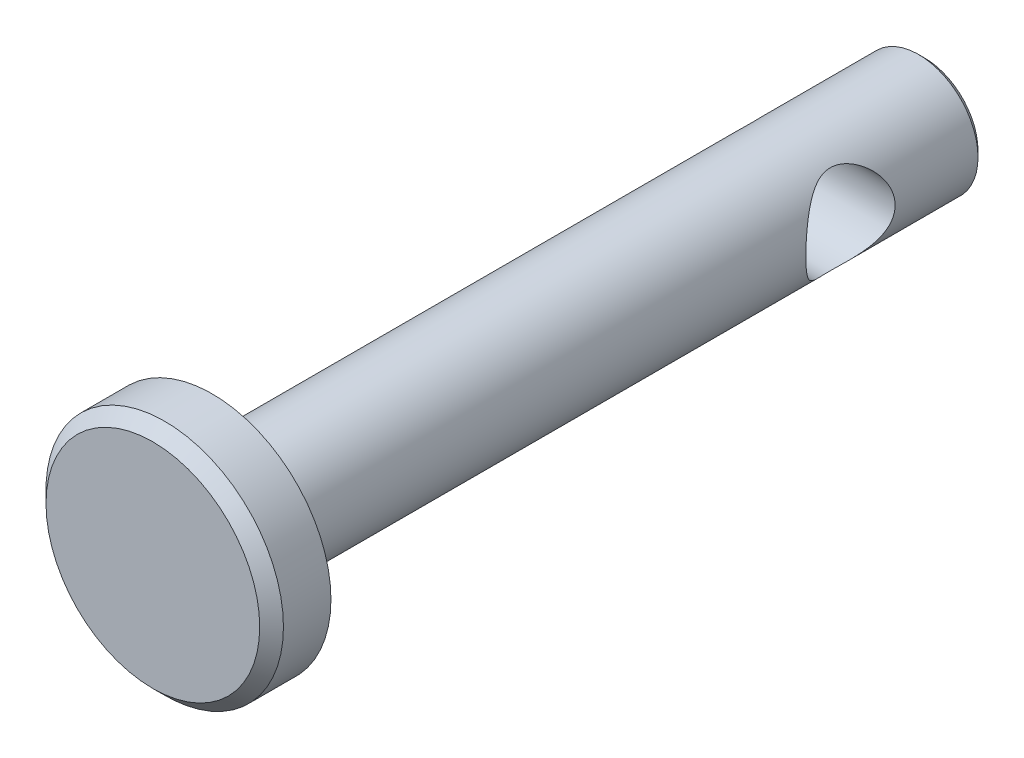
ISO-10303-21;
HEADER;
FILE_DESCRIPTION(('STEP AP214'),'2;1');
FILE_NAME('part.step','',(''),(''),'','','');
FILE_SCHEMA(('AUTOMOTIVE_DESIGN { 1 0 10303 214 1 1 1 1 }'));
ENDSEC;
DATA;
#1=APPLICATION_CONTEXT('core data for automotive mechanical design processes');
#2=APPLICATION_PROTOCOL_DEFINITION('international standard','automotive_design',2000,#1);
#3=PRODUCT_CONTEXT('',#1,'mechanical');
#4=PRODUCT('Part','Part','',(#3));
#5=PRODUCT_RELATED_PRODUCT_CATEGORY('part','',(#4));
#6=PRODUCT_DEFINITION_FORMATION('','',#4);
#7=PRODUCT_DEFINITION_CONTEXT('part definition',#1,'design');
#8=PRODUCT_DEFINITION('design','',#6,#7);
#9=PRODUCT_DEFINITION_SHAPE('','',#8);
#10=(LENGTH_UNIT() NAMED_UNIT(*) SI_UNIT(.MILLI.,.METRE.));
#11=(NAMED_UNIT(*) PLANE_ANGLE_UNIT() SI_UNIT($,.RADIAN.));
#12=(NAMED_UNIT(*) SI_UNIT($,.STERADIAN.) SOLID_ANGLE_UNIT());
#13=UNCERTAINTY_MEASURE_WITH_UNIT(LENGTH_MEASURE(1.E-05),#10,'distance_accuracy_value','');
#14=(GEOMETRIC_REPRESENTATION_CONTEXT(3) GLOBAL_UNCERTAINTY_ASSIGNED_CONTEXT((#13)) GLOBAL_UNIT_ASSIGNED_CONTEXT((#10,
#11,#12)) REPRESENTATION_CONTEXT('',''));
#15=CARTESIAN_POINT('',(0.,0.,0.));
#16=DIRECTION('',(0.,0.,1.));
#17=DIRECTION('',(1.,0.,0.));
#18=AXIS2_PLACEMENT_3D('',#15,#16,#17);
#19=CARTESIAN_POINT('',(0.,0.,9.525));
#20=DIRECTION('',(0.,0.,-1.));
#21=DIRECTION('',(-1.,0.,0.));
#22=AXIS2_PLACEMENT_3D('',#19,#20,#21);
#23=CYLINDRICAL_SURFACE('',#22,1.5875);
#24=CARTESIAN_POINT('',(0.,0.,-9.36624999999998));
#25=DIRECTION('',(0.,0.,1.));
#26=DIRECTION('',(1.,0.,0.));
#27=AXIS2_PLACEMENT_3D('',#24,#25,#26);
#28=CIRCLE('',#27,1.5875);
#29=CARTESIAN_POINT('',(1.5875,0.,-9.36624999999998));
#30=VERTEX_POINT('',#29);
#31=EDGE_CURVE('E37',#30,#30,#28,.T.);
#32=ORIENTED_EDGE('',*,*,#31,.T.);
#33=EDGE_LOOP('',(#32));
#34=FACE_BOUND('',#33,.T.);
#35=CARTESIAN_POINT('',(-1.5875,0.,-4.7625));
#36=CARTESIAN_POINT('',(-1.58749611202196,-0.0582400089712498,-4.76250404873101));
#37=CARTESIAN_POINT('',(-1.58426132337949,-0.116571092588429,-4.76679645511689));
#38=CARTESIAN_POINT('',(-1.57161329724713,-0.231395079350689,-4.78369572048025));
#39=CARTESIAN_POINT('',(-1.56218511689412,-0.287883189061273,-4.7963226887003));
#40=CARTESIAN_POINT('',(-1.53805521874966,-0.397051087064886,-4.82903029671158));
#41=CARTESIAN_POINT('',(-1.52338545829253,-0.449751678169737,-4.84906579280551));
#42=CARTESIAN_POINT('',(-1.48987548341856,-0.550689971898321,-4.89564346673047));
#43=CARTESIAN_POINT('',(-1.4710363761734,-0.598928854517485,-4.92218391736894));
#44=CARTESIAN_POINT('',(-1.42848471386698,-0.6946800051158,-4.98361872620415));
#45=CARTESIAN_POINT('',(-1.4044822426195,-0.741710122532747,-5.0190595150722));
#46=CARTESIAN_POINT('',(-1.35445854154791,-0.829553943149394,-5.09582999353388));
#47=CARTESIAN_POINT('',(-1.32843424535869,-0.870357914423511,-5.1371687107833));
#48=CARTESIAN_POINT('',(-1.27068479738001,-0.953179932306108,-5.23416999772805));
#49=CARTESIAN_POINT('',(-1.23888117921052,-0.993742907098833,-5.29103351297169));
#50=CARTESIAN_POINT('',(-1.17827563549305,-1.06489206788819,-5.41216340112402));
#51=CARTESIAN_POINT('',(-1.14946970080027,-1.09549169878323,-5.47641963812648));
#52=CARTESIAN_POINT('',(-1.10835974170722,-1.13676501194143,-5.58866025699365));
#53=CARTESIAN_POINT('',(-1.09379064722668,-1.1506712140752,-5.63461480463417));
#54=CARTESIAN_POINT('',(-1.06983233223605,-1.17298121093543,-5.72910159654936));
#55=CARTESIAN_POINT('',(-1.06043121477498,-1.1813976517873,-5.77762763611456));
#56=CARTESIAN_POINT('',(-1.04829075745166,-1.19218967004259,-5.87667588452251));
#57=CARTESIAN_POINT('',(-1.045613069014,-1.19450935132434,-5.92721228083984));
#58=CARTESIAN_POINT('',(-1.04766413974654,-1.19270985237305,-6.02802847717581));
#59=CARTESIAN_POINT('',(-1.0523953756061,-1.18858851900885,-6.07830818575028));
#60=CARTESIAN_POINT('',(-1.06743533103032,-1.17508360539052,-6.17150859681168));
#61=CARTESIAN_POINT('',(-1.07708192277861,-1.16632068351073,-6.21463515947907));
#62=CARTESIAN_POINT('',(-1.10026903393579,-1.14447308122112,-6.29868602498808));
#63=CARTESIAN_POINT('',(-1.11381333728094,-1.13138419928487,-6.33960814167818));
#64=CARTESIAN_POINT('',(-1.15290197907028,-1.09185551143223,-6.44394351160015));
#65=CARTESIAN_POINT('',(-1.18063622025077,-1.06219612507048,-6.50531645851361));
#66=CARTESIAN_POINT('',(-1.23884845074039,-0.993702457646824,-6.6213324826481));
#67=CARTESIAN_POINT('',(-1.26933302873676,-0.954845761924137,-6.67595861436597));
#68=CARTESIAN_POINT('',(-1.33071770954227,-0.867340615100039,-6.77945482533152));
#69=CARTESIAN_POINT('',(-1.36160815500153,-0.818464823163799,-6.82813939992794));
#70=CARTESIAN_POINT('',(-1.42018729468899,-0.711972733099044,-6.9170529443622));
#71=CARTESIAN_POINT('',(-1.44788202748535,-0.654373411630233,-6.9572979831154));
#72=CARTESIAN_POINT('',(-1.49255937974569,-0.543375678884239,-7.02078774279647));
#73=CARTESIAN_POINT('',(-1.51057698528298,-0.491421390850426,-7.04582173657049));
#74=CARTESIAN_POINT('',(-1.54160267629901,-0.383120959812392,-7.08844643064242));
#75=CARTESIAN_POINT('',(-1.55461387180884,-0.326777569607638,-7.10604175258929));
#76=CARTESIAN_POINT('',(-1.57456526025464,-0.210682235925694,-7.13287955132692));
#77=CARTESIAN_POINT('',(-1.58146728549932,-0.1509113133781,-7.14206952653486));
#78=CARTESIAN_POINT('',(-1.58835864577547,-0.0302752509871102,-7.15124574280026));
#79=CARTESIAN_POINT('',(-1.58835103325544,0.0305893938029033,-7.15123604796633));
#80=CARTESIAN_POINT('',(-1.58179458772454,0.145018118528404,-7.14250495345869));
#81=CARTESIAN_POINT('',(-1.57591384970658,0.198692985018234,-7.13467332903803));
#82=CARTESIAN_POINT('',(-1.55908265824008,0.303723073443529,-7.11206716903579));
#83=CARTESIAN_POINT('',(-1.54813114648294,0.355077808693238,-7.09729118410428));
#84=CARTESIAN_POINT('',(-1.5215117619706,0.456045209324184,-7.0609081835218));
#85=CARTESIAN_POINT('',(-1.50569808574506,0.505541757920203,-7.0390887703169));
#86=CARTESIAN_POINT('',(-1.47055050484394,0.600156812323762,-6.98965499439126));
#87=CARTESIAN_POINT('',(-1.45121610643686,0.645274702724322,-6.96203981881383));
#88=CARTESIAN_POINT('',(-1.40668133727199,0.737877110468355,-6.89673625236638));
#89=CARTESIAN_POINT('',(-1.38104027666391,0.78450486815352,-6.85813622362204));
#90=CARTESIAN_POINT('',(-1.32814791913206,0.871068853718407,-6.77484438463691));
#91=CARTESIAN_POINT('',(-1.30089319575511,0.91099009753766,-6.73013932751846));
#92=CARTESIAN_POINT('',(-1.24150416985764,0.990828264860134,-6.6260177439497));
#93=CARTESIAN_POINT('',(-1.20943783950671,1.02927233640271,-6.56542468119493));
#94=CARTESIAN_POINT('',(-1.14994929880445,1.09532583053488,-6.43654051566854));
#95=CARTESIAN_POINT('',(-1.12251399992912,1.12296608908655,-6.36827204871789));
#96=CARTESIAN_POINT('',(-1.08675452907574,1.15736064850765,-6.25256084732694));
#97=CARTESIAN_POINT('',(-1.07514574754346,1.16805755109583,-6.20731938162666));
#98=CARTESIAN_POINT('',(-1.05740659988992,1.18414258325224,-6.1149003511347));
#99=CARTESIAN_POINT('',(-1.05126379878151,1.18954276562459,-6.06772743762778));
#100=CARTESIAN_POINT('',(-1.04546055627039,1.19464934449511,-5.97239421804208));
#101=CARTESIAN_POINT('',(-1.04583560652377,1.19432456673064,-5.92422993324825));
#102=CARTESIAN_POINT('',(-1.05308483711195,1.18793443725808,-5.82875862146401));
#103=CARTESIAN_POINT('',(-1.05996708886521,1.18186195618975,-5.78145273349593));
#104=CARTESIAN_POINT('',(-1.08105685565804,1.16263091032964,-5.67939139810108));
#105=CARTESIAN_POINT('',(-1.09648769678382,1.14826379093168,-5.62512604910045));
#106=CARTESIAN_POINT('',(-1.13243372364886,1.11282760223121,-5.52059746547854));
#107=CARTESIAN_POINT('',(-1.15296179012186,1.09174151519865,-5.47034480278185));
#108=CARTESIAN_POINT('',(-1.20451193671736,1.03501018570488,-5.35693003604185));
#109=CARTESIAN_POINT('',(-1.23666801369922,0.996854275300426,-5.29554225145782));
#110=CARTESIAN_POINT('',(-1.30163587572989,0.910405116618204,-5.18074463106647));
#111=CARTESIAN_POINT('',(-1.33444825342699,0.862102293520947,-5.12734241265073));
#112=CARTESIAN_POINT('',(-1.39773998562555,0.755232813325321,-5.02888025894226));
#113=CARTESIAN_POINT('',(-1.42819461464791,0.696574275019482,-4.98390312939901));
#114=CARTESIAN_POINT('',(-1.48324162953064,0.569981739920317,-4.9047231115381));
#115=CARTESIAN_POINT('',(-1.50784795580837,0.50207041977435,-4.87049453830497));
#116=CARTESIAN_POINT('',(-1.54233051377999,0.379688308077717,-4.82317967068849));
#117=CARTESIAN_POINT('',(-1.55440989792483,0.327083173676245,-4.80683830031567));
#118=CARTESIAN_POINT('',(-1.57322723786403,0.219278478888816,-4.78151498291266));
#119=CARTESIAN_POINT('',(-1.57997976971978,0.164086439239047,-4.77251295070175));
#120=CARTESIAN_POINT('',(-1.58502674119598,0.0904161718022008,-4.76579069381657));
#121=CARTESIAN_POINT('',(-1.58595256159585,0.072371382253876,-4.76455840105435));
#122=CARTESIAN_POINT('',(-1.58718985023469,0.0362206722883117,-4.76291235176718));
#123=CARTESIAN_POINT('',(-1.58750120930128,0.0181147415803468,-4.76249874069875));
#124=CARTESIAN_POINT('',(-1.5875,0.,-4.7625));
#125=B_SPLINE_CURVE_WITH_KNOTS('',3,(#35,#36,#37,#38,#39,#40,#41,#42,#43,#44,#45,#46,#47,#48,
#49,#50,#51,#52,#53,#54,#55,#56,#57,#58,#59,#60,#61,#62,#63,#64,#65,#66,#67,#68,#69,#70,#71,#72,
#73,#74,#75,#76,#77,#78,#79,#80,#81,#82,#83,#84,#85,#86,#87,#88,#89,#90,#91,#92,#93,#94,#95,#96,
#97,#98,#99,#100,#101,#102,#103,#104,#105,#106,#107,#108,#109,#110,#111,#112,#113,#114,#115,
#116,#117,#118,#119,#120,#121,#122,#123,#124),.UNSPECIFIED.,.T.,.F.,(4,2,2,2,2,2,2,2,2,2,2,2,2,
2,2,2,2,2,2,2,2,2,2,2,2,2,2,2,2,2,2,2,2,2,2,2,2,2,2,2,2,2,2,2,4),(0.,0.174640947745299,
0.349704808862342,0.523719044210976,0.697687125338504,0.887786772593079,1.07818058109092,
1.30747198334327,1.53645267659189,1.68647155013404,1.83614361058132,1.98718317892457,
2.13827324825,2.27294091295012,2.40773975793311,2.62731202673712,2.84742502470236,
3.07323328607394,3.29860762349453,3.47914313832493,3.65956632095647,3.84110891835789,
4.02257131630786,4.18550204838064,4.34846680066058,4.51689478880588,4.68534641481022,
4.88184568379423,5.07877830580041,5.31352668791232,5.54760007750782,5.69082209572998,
5.83371744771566,5.97739115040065,6.12124329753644,6.29493375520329,6.4690676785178,
6.70520286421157,6.94156188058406,7.18013431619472,7.41813223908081,7.58663566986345,
7.75467640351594,7.80898638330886,7.86330601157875),.UNSPECIFIED.);
#126=CARTESIAN_POINT('',(-1.5875,0.,-4.7625));
#127=VERTEX_POINT('',#126);
#128=EDGE_CURVE('E48',#127,#127,#125,.T.);
#129=ORIENTED_EDGE('',*,*,#128,.T.);
#130=EDGE_LOOP('',(#129));
#131=FACE_BOUND('',#130,.T.);
#132=CARTESIAN_POINT('',(1.5875,0.,-7.1501));
#133=CARTESIAN_POINT('',(1.58749611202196,-0.0582400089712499,-7.15009595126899));
#134=CARTESIAN_POINT('',(1.58426132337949,-0.116571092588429,-7.1458035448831));
#135=CARTESIAN_POINT('',(1.57161329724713,-0.231395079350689,-7.12890427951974));
#136=CARTESIAN_POINT('',(1.56218511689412,-0.287883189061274,-7.11627731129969));
#137=CARTESIAN_POINT('',(1.53805521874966,-0.397051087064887,-7.08356970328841));
#138=CARTESIAN_POINT('',(1.52338545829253,-0.449751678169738,-7.06353420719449));
#139=CARTESIAN_POINT('',(1.48987548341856,-0.550689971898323,-7.01695653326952));
#140=CARTESIAN_POINT('',(1.4710363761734,-0.598928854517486,-6.99041608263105));
#141=CARTESIAN_POINT('',(1.42848471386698,-0.694680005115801,-6.92898127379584));
#142=CARTESIAN_POINT('',(1.4044822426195,-0.741710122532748,-6.89354048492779));
#143=CARTESIAN_POINT('',(1.35445854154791,-0.829553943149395,-6.81677000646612));
#144=CARTESIAN_POINT('',(1.32843424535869,-0.870357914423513,-6.7754312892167));
#145=CARTESIAN_POINT('',(1.27068479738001,-0.953179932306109,-6.67843000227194));
#146=CARTESIAN_POINT('',(1.23888117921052,-0.993742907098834,-6.62156648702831));
#147=CARTESIAN_POINT('',(1.17827563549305,-1.0648920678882,-6.50043659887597));
#148=CARTESIAN_POINT('',(1.14946970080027,-1.09549169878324,-6.43618036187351));
#149=CARTESIAN_POINT('',(1.10835974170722,-1.13676501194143,-6.32393974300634));
#150=CARTESIAN_POINT('',(1.09379064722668,-1.1506712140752,-6.27798519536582));
#151=CARTESIAN_POINT('',(1.06983233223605,-1.17298121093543,-6.18349840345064));
#152=CARTESIAN_POINT('',(1.06043121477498,-1.1813976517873,-6.13497236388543));
#153=CARTESIAN_POINT('',(1.04829075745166,-1.19218967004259,-6.03592411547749));
#154=CARTESIAN_POINT('',(1.045613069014,-1.19450935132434,-5.98538771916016));
#155=CARTESIAN_POINT('',(1.04766413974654,-1.19270985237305,-5.88457152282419));
#156=CARTESIAN_POINT('',(1.0523953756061,-1.18858851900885,-5.83429181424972));
#157=CARTESIAN_POINT('',(1.06743533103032,-1.17508360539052,-5.74109140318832));
#158=CARTESIAN_POINT('',(1.07708192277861,-1.16632068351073,-5.69796484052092));
#159=CARTESIAN_POINT('',(1.10026903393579,-1.14447308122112,-5.61391397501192));
#160=CARTESIAN_POINT('',(1.11381333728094,-1.13138419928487,-5.57299185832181));
#161=CARTESIAN_POINT('',(1.15290197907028,-1.09185551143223,-5.46865648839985));
#162=CARTESIAN_POINT('',(1.18063622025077,-1.06219612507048,-5.40728354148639));
#163=CARTESIAN_POINT('',(1.23884845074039,-0.993702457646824,-5.2912675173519));
#164=CARTESIAN_POINT('',(1.26933302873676,-0.954845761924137,-5.23664138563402));
#165=CARTESIAN_POINT('',(1.33071770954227,-0.867340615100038,-5.13314517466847));
#166=CARTESIAN_POINT('',(1.36160815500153,-0.818464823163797,-5.08446060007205));
#167=CARTESIAN_POINT('',(1.42018729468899,-0.711972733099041,-4.99554705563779));
#168=CARTESIAN_POINT('',(1.44788202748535,-0.65437341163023,-4.95530201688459));
#169=CARTESIAN_POINT('',(1.49255937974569,-0.543375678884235,-4.89181225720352));
#170=CARTESIAN_POINT('',(1.51057698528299,-0.491421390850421,-4.8667782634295));
#171=CARTESIAN_POINT('',(1.54160267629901,-0.383120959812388,-4.82415356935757));
#172=CARTESIAN_POINT('',(1.55461387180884,-0.326777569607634,-4.8065582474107));
#173=CARTESIAN_POINT('',(1.57456526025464,-0.21068223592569,-4.77972044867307));
#174=CARTESIAN_POINT('',(1.58146728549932,-0.150911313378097,-4.77053047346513));
#175=CARTESIAN_POINT('',(1.58835864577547,-0.0302752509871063,-4.76135425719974));
#176=CARTESIAN_POINT('',(1.58835103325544,0.0305893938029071,-4.76136395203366));
#177=CARTESIAN_POINT('',(1.58179458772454,0.145018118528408,-4.7700950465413));
#178=CARTESIAN_POINT('',(1.57591384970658,0.198692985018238,-4.77792667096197));
#179=CARTESIAN_POINT('',(1.55908265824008,0.303723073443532,-4.80053283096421));
#180=CARTESIAN_POINT('',(1.54813114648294,0.35507780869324,-4.81530881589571));
#181=CARTESIAN_POINT('',(1.52151176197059,0.456045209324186,-4.8516918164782));
#182=CARTESIAN_POINT('',(1.50569808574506,0.505541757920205,-4.87351122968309));
#183=CARTESIAN_POINT('',(1.47055050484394,0.600156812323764,-4.92294500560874));
#184=CARTESIAN_POINT('',(1.45121610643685,0.645274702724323,-4.95056018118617));
#185=CARTESIAN_POINT('',(1.40668133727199,0.737877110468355,-5.01586374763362));
#186=CARTESIAN_POINT('',(1.38104027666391,0.784504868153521,-5.05446377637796));
#187=CARTESIAN_POINT('',(1.32814791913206,0.871068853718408,-5.13775561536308));
#188=CARTESIAN_POINT('',(1.30089319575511,0.910990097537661,-5.18246067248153));
#189=CARTESIAN_POINT('',(1.24150416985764,0.990828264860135,-5.2865822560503));
#190=CARTESIAN_POINT('',(1.20943783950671,1.02927233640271,-5.34717531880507));
#191=CARTESIAN_POINT('',(1.14994929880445,1.09532583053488,-5.47605948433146));
#192=CARTESIAN_POINT('',(1.12251399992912,1.12296608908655,-5.54432795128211));
#193=CARTESIAN_POINT('',(1.08675452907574,1.15736064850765,-5.66003915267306));
#194=CARTESIAN_POINT('',(1.07514574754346,1.16805755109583,-5.70528061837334));
#195=CARTESIAN_POINT('',(1.05740659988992,1.18414258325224,-5.79769964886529));
#196=CARTESIAN_POINT('',(1.05126379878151,1.18954276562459,-5.84487256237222));
#197=CARTESIAN_POINT('',(1.04546055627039,1.19464934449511,-5.94020578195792));
#198=CARTESIAN_POINT('',(1.04583560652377,1.19432456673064,-5.98837006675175));
#199=CARTESIAN_POINT('',(1.05308483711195,1.18793443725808,-6.08384137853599));
#200=CARTESIAN_POINT('',(1.05996708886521,1.18186195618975,-6.13114726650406));
#201=CARTESIAN_POINT('',(1.08105685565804,1.16263091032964,-6.23320860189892));
#202=CARTESIAN_POINT('',(1.09648769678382,1.14826379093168,-6.28747395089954));
#203=CARTESIAN_POINT('',(1.13243372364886,1.11282760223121,-6.39200253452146));
#204=CARTESIAN_POINT('',(1.15296179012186,1.09174151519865,-6.44225519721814));
#205=CARTESIAN_POINT('',(1.20451193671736,1.03501018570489,-6.55566996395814));
#206=CARTESIAN_POINT('',(1.23666801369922,0.996854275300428,-6.61705774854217));
#207=CARTESIAN_POINT('',(1.30163587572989,0.910405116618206,-6.73185536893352));
#208=CARTESIAN_POINT('',(1.33444825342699,0.86210229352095,-6.78525758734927));
#209=CARTESIAN_POINT('',(1.39773998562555,0.755232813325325,-6.88371974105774));
#210=CARTESIAN_POINT('',(1.42819461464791,0.696574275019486,-6.92869687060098));
#211=CARTESIAN_POINT('',(1.48324162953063,0.569981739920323,-7.00787688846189));
#212=CARTESIAN_POINT('',(1.50784795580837,0.502070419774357,-7.04210546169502));
#213=CARTESIAN_POINT('',(1.54233051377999,0.379688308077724,-7.0894203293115));
#214=CARTESIAN_POINT('',(1.55440989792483,0.327083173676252,-7.10576169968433));
#215=CARTESIAN_POINT('',(1.57322723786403,0.219278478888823,-7.13108501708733));
#216=CARTESIAN_POINT('',(1.57997976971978,0.164086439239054,-7.14008704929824));
#217=CARTESIAN_POINT('',(1.58502674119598,0.0904161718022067,-7.14680930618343));
#218=CARTESIAN_POINT('',(1.58595256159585,0.0723713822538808,-7.14804159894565));
#219=CARTESIAN_POINT('',(1.58718985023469,0.0362206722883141,-7.14968764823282));
#220=CARTESIAN_POINT('',(1.58750120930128,0.018114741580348,-7.15010125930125));
#221=CARTESIAN_POINT('',(1.5875,0.,-7.1501));
#222=B_SPLINE_CURVE_WITH_KNOTS('',3,(#132,#133,#134,#135,#136,#137,#138,#139,#140,#141,#142,
#143,#144,#145,#146,#147,#148,#149,#150,#151,#152,#153,#154,#155,#156,#157,#158,#159,#160,#161,
#162,#163,#164,#165,#166,#167,#168,#169,#170,#171,#172,#173,#174,#175,#176,#177,#178,#179,#180,
#181,#182,#183,#184,#185,#186,#187,#188,#189,#190,#191,#192,#193,#194,#195,#196,#197,#198,#199,
#200,#201,#202,#203,#204,#205,#206,#207,#208,#209,#210,#211,#212,#213,#214,#215,#216,#217,#218,
#219,#220,#221),.UNSPECIFIED.,.T.,.F.,(4,2,2,2,2,2,2,2,2,2,2,2,2,2,2,2,2,2,2,2,2,2,2,2,2,2,2,2,
2,2,2,2,2,2,2,2,2,2,2,2,2,2,2,2,4),(0.,0.1746409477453,0.349704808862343,0.523719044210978,
0.697687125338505,0.887786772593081,1.07818058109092,1.30747198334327,1.53645267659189,
1.68647155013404,1.83614361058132,1.98718317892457,2.13827324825,2.27294091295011,
2.40773975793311,2.62731202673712,2.84742502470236,3.07323328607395,3.29860762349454,
3.47914313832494,3.65956632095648,3.84110891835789,4.02257131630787,4.18550204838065,
4.34846680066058,4.51689478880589,4.68534641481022,4.88184568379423,5.07877830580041,
5.31352668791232,5.54760007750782,5.69082209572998,5.83371744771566,5.97739115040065,
6.12124329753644,6.29493375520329,6.4690676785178,6.70520286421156,6.94156188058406,
7.18013431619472,7.4181322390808,7.58663566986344,7.75467640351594,7.80898638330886,
7.86330601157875),.UNSPECIFIED.);
#223=CARTESIAN_POINT('',(1.5875,0.,-7.1501));
#224=VERTEX_POINT('',#223);
#225=EDGE_CURVE('E57',#224,#224,#222,.T.);
#226=ORIENTED_EDGE('',*,*,#225,.T.);
#227=EDGE_LOOP('',(#226));
#228=FACE_BOUND('',#227,.T.);
#229=CARTESIAN_POINT('',(0.,0.,9.525));
#230=DIRECTION('',(0.,0.,1.));
#231=DIRECTION('',(1.,0.,0.));
#232=AXIS2_PLACEMENT_3D('',#229,#230,#231);
#233=CIRCLE('',#232,1.5875);
#234=CARTESIAN_POINT('',(1.5875,0.,9.525));
#235=VERTEX_POINT('',#234);
#236=EDGE_CURVE('E96',#235,#235,#233,.T.);
#237=ORIENTED_EDGE('',*,*,#236,.F.);
#238=EDGE_LOOP('',(#237));
#239=FACE_BOUND('',#238,.T.);
#240=ADVANCED_FACE('F30',(#34,#131,#228,#239),#23,.T.);
#241=CARTESIAN_POINT('',(0.,0.,-9.525));
#242=DIRECTION('',(0.,0.,1.));
#243=DIRECTION('',(1.,0.,0.));
#244=AXIS2_PLACEMENT_3D('',#241,#242,#243);
#245=PLANE('',#244);
#246=CARTESIAN_POINT('',(0.,0.,-9.525));
#247=DIRECTION('',(0.,0.,1.));
#248=DIRECTION('',(1.,0.,0.));
#249=AXIS2_PLACEMENT_3D('',#246,#247,#248);
#250=CIRCLE('',#249,1.42874999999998);
#251=CARTESIAN_POINT('',(1.42874999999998,0.,-9.525));
#252=VERTEX_POINT('',#251);
#253=EDGE_CURVE('E10',#252,#252,#250,.F.);
#254=ORIENTED_EDGE('',*,*,#253,.T.);
#255=EDGE_LOOP('',(#254));
#256=FACE_BOUND('',#255,.T.);
#257=ADVANCED_FACE('F78',(#256),#245,.F.);
#258=CARTESIAN_POINT('',(0.,0.,9.525));
#259=DIRECTION('',(0.,0.,1.));
#260=DIRECTION('',(1.,0.,0.));
#261=AXIS2_PLACEMENT_3D('',#258,#259,#260);
#262=PLANE('',#261);
#263=CARTESIAN_POINT('',(0.,0.,9.525));
#264=DIRECTION('',(0.,0.,1.));
#265=DIRECTION('',(1.,0.,0.));
#266=AXIS2_PLACEMENT_3D('',#263,#264,#265);
#267=CIRCLE('',#266,3.175);
#268=CARTESIAN_POINT('',(3.175,0.,9.525));
#269=VERTEX_POINT('',#268);
#270=EDGE_CURVE('E56',#269,#269,#267,.T.);
#271=ORIENTED_EDGE('',*,*,#270,.F.);
#272=EDGE_LOOP('',(#271));
#273=FACE_BOUND('',#272,.T.);
#274=ORIENTED_EDGE('',*,*,#236,.T.);
#275=EDGE_LOOP('',(#274));
#276=FACE_BOUND('',#275,.T.);
#277=ADVANCED_FACE('F75',(#273,#276),#262,.F.);
#278=CARTESIAN_POINT('',(0.,0.,11.1125));
#279=DIRECTION('',(0.,0.,-1.));
#280=DIRECTION('',(-1.,0.,0.));
#281=AXIS2_PLACEMENT_3D('',#278,#279,#280);
#282=CYLINDRICAL_SURFACE('',#281,3.175);
#283=CARTESIAN_POINT('',(0.,0.,10.795));
#284=DIRECTION('',(0.,0.,1.));
#285=DIRECTION('',(1.,0.,0.));
#286=AXIS2_PLACEMENT_3D('',#283,#284,#285);
#287=CIRCLE('',#286,3.175);
#288=CARTESIAN_POINT('',(3.175,0.,10.795));
#289=VERTEX_POINT('',#288);
#290=EDGE_CURVE('E41',#289,#289,#287,.F.);
#291=ORIENTED_EDGE('',*,*,#290,.T.);
#292=EDGE_LOOP('',(#291));
#293=FACE_BOUND('',#292,.T.);
#294=ORIENTED_EDGE('',*,*,#270,.T.);
#295=EDGE_LOOP('',(#294));
#296=FACE_BOUND('',#295,.T.);
#297=ADVANCED_FACE('F73',(#293,#296),#282,.T.);
#298=CARTESIAN_POINT('',(0.,0.,11.1125));
#299=DIRECTION('',(0.,0.,1.));
#300=DIRECTION('',(1.,0.,0.));
#301=AXIS2_PLACEMENT_3D('',#298,#299,#300);
#302=PLANE('',#301);
#303=CARTESIAN_POINT('',(0.,0.,11.1125));
#304=DIRECTION('',(0.,0.,1.));
#305=DIRECTION('',(1.,0.,0.));
#306=AXIS2_PLACEMENT_3D('',#303,#304,#305);
#307=CIRCLE('',#306,2.8575);
#308=CARTESIAN_POINT('',(2.8575,0.,11.1125));
#309=VERTEX_POINT('',#308);
#310=EDGE_CURVE('E45',#309,#309,#307,.T.);
#311=ORIENTED_EDGE('',*,*,#310,.T.);
#312=EDGE_LOOP('',(#311));
#313=FACE_BOUND('',#312,.T.);
#314=ADVANCED_FACE('F69',(#313),#302,.T.);
#315=CARTESIAN_POINT('',(0.,0.,11.1125));
#316=DIRECTION('',(0.,0.,-1.));
#317=DIRECTION('',(-1.,0.,0.));
#318=AXIS2_PLACEMENT_3D('',#315,#316,#317);
#319=CONICAL_SURFACE('',#318,2.8575,0.785398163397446);
#320=ORIENTED_EDGE('',*,*,#290,.F.);
#321=EDGE_LOOP('',(#320));
#322=FACE_BOUND('',#321,.T.);
#323=ORIENTED_EDGE('',*,*,#310,.F.);
#324=EDGE_LOOP('',(#323));
#325=FACE_BOUND('',#324,.T.);
#326=ADVANCED_FACE('F67',(#322,#325),#319,.T.);
#327=CARTESIAN_POINT('',(-3.175,0.,-5.9563));
#328=DIRECTION('',(1.,0.,0.));
#329=DIRECTION('',(0.,0.,-1.));
#330=AXIS2_PLACEMENT_3D('',#327,#328,#329);
#331=CYLINDRICAL_SURFACE('',#330,1.1938);
#332=ORIENTED_EDGE('',*,*,#225,.F.);
#333=EDGE_LOOP('',(#332));
#334=FACE_BOUND('',#333,.T.);
#335=ORIENTED_EDGE('',*,*,#128,.F.);
#336=EDGE_LOOP('',(#335));
#337=FACE_BOUND('',#336,.T.);
#338=ADVANCED_FACE('F63',(#334,#337),#331,.F.);
#339=CARTESIAN_POINT('',(0.,0.,-9.36624999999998));
#340=DIRECTION('',(0.,0.,1.));
#341=DIRECTION('',(1.,0.,0.));
#342=AXIS2_PLACEMENT_3D('',#339,#340,#341);
#343=CONICAL_SURFACE('',#342,1.5875,0.78539816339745);
#344=ORIENTED_EDGE('',*,*,#253,.F.);
#345=EDGE_LOOP('',(#344));
#346=FACE_BOUND('',#345,.T.);
#347=ORIENTED_EDGE('',*,*,#31,.F.);
#348=EDGE_LOOP('',(#347));
#349=FACE_BOUND('',#348,.T.);
#350=ADVANCED_FACE('F32',(#346,#349),#343,.T.);
#351=CLOSED_SHELL('',(#240,#257,#277,#297,#314,#326,#338,#350));
#352=MANIFOLD_SOLID_BREP('B2',#351);
#353=ADVANCED_BREP_SHAPE_REPRESENTATION('',(#18,#352),#14);
#354=SHAPE_DEFINITION_REPRESENTATION(#9,#353);
ENDSEC;
END-ISO-10303-21;
